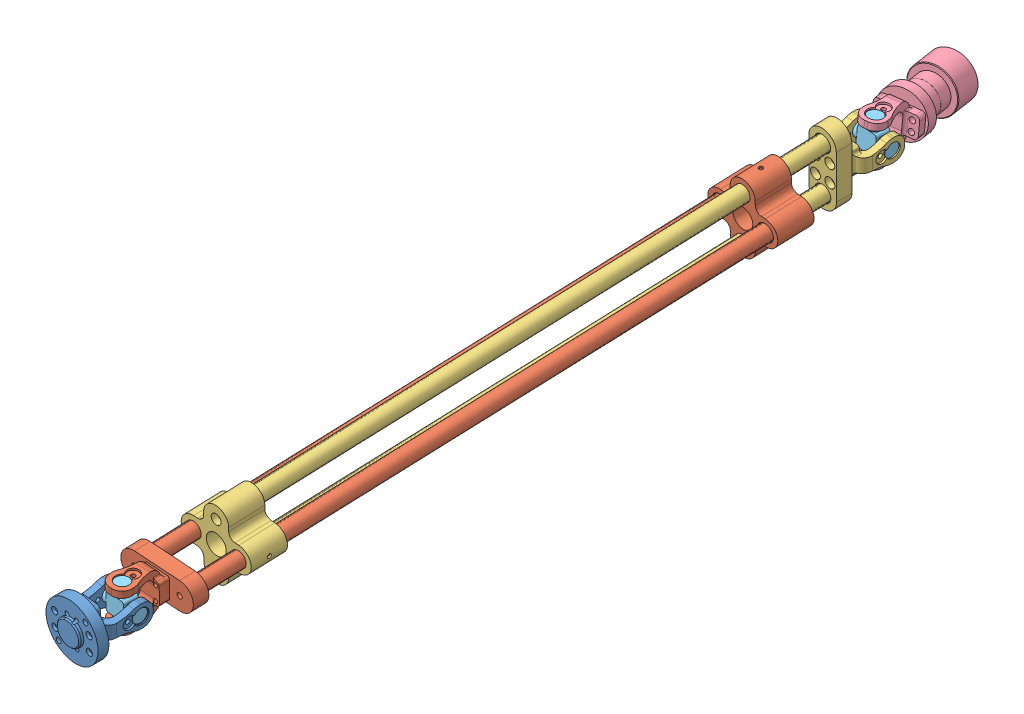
SolidWorks assembly PAR6PL10A004 中间轴.SLDASM, configuration 默认 (file format 7000). Lengths in mm.
Overall size (67.77 90.01 704.56).
6 component instances, 5 part files, 10 mates.
Components (placement in the parent):
- PAR6PL10A004 中间轴-上1-1: PAR6PL10A004 中间轴-上1.SLDPRT [默认] at origin size (44.45 44.44 50.8)
- PAR6PL10A004 中间轴-上2-1: PAR6PL10A004 中间轴-上2.SLDPRT [默认] at (8.8113 27.1532 -0.4023) x (0.999836 0.002846 0.017912) z (-0.017728 -0.055095 0.998324) size (57.94 55.94 517)
- PAR6PL10A004 中间轴-下1-1: PAR6PL10A004 中间轴-下1.SLDPRT [默认] at (8.8636 27.3156 -3.346) x (0.999836 0.002846 0.017912) z (-0.017728 -0.055095 0.998324) size (55.94 57.94 517)
- PAR6PL10A004 中间轴-下2-1: PAR6PL10A004 中间轴-下2.SLDPRT [默认] at (30.6658 32.3586 -15.6175) x (0.959454 -0.011 -0.28165) z (0.281444 -0.0172 0.959424) size (39.6 38.78 89.97)
- 万向轴承-1: 万向轴承.SLDPRT [默认] at (-7.1455 39.8233 492.583) x (0.06978 0.052248 -0.996193) z (-0.052248 -0.997065 -0.055954) size (11 30 30)
- 万向轴承-3: 万向轴承.SLDPRT [默认] at (3.1741 71.8192 -88.8315) x (0.011872 -0.054924 -0.99842) z (-0.053881 -0.997075 0.05421) size (11 30 30)
Mates (geometry in assembly coordinates):
- 同心2: concentric aligned: cylinder of PAR6PL10A004 中间轴-上2-1 through (-7.0933 40.8204 492.6389) axis (-0.052248 -0.997065 -0.055954) radius 5.5; cylinder of 万向轴承-1 through (-7.1455 39.8233 492.583) axis (-0.052248 -0.997065 -0.055954) radius 5.5
- 宽度1: width aligned: plane of PAR6PL10A004 中间轴-上2-1 through (0.6466 9.7582 467.0218) normal (0.052248 0.997065 0.055954); plane of PAR6PL10A004 中间轴-上2-1 through (1.7335 39.8462 501.757) normal (-0.052248 -0.997065 -0.055954); plane of 万向轴承-1 through (-15.9398 39.8539 500.2501) normal (0.052248 0.997065 0.055954); plane of 万向轴承-1 through (-17.5072 9.9419 498.5715) normal (-0.052248 -0.997065 -0.055954)
- 同心3: concentric anti-aligned: cylinder of PAR6PL10A004 中间轴-上1-1 through (8.0099 23.9721 492.8132) axis (-0.996193 0.055954 -0.066845) radius 5.5; cylinder of 万向轴承-1 through (-22.8721 25.7066 490.741) axis (0.996193 -0.055954 0.066845) radius 5.5
- 宽度2: width aligned: plane of 万向轴承-1 through (6.7271 33.8517 505.2398) normal (0.996193 -0.055954 0.066845); plane of 万向轴承-1 through (-23.1587 35.5303 503.2345) normal (-0.996193 0.055954 -0.066845); plane of PAR6PL10A004 中间轴-上1-1 through (9.1056 33.5434 484.4952) normal (0.996193 -0.055954 0.066845); plane of PAR6PL10A004 中间轴-上1-1 through (-25.2422 32.9777 517.1893) normal (-0.996193 0.055954 -0.066845)
- 同心4: concentric aligned: cylinder of PAR6PL10A004 中间轴-上2-1 through (2.4581 72.1741 -39.2435) axis (-0.017728 -0.055095 0.998324) radius 6; cylinder of PAR6PL10A004 中间轴-下1-1 through (2.739 73.0473 -55.0649) axis (-0.017728 -0.055095 0.998324) radius 6
- 同心5: concentric anti-aligned: cylinder of PAR6PL10A004 中间轴-上2-1 through (0.5772 36.2798 -41.2578) axis (-0.017728 -0.055095 0.998324) radius 6; cylinder of PAR6PL10A004 中间轴-下1-1 through (-7.2612 11.9193 400.1531) axis (0.017728 0.055095 -0.998324) radius 6
- 同心6: concentric aligned: cylinder of PAR6PL10A004 中间轴-下2-1 through (3.228 72.8163 -88.8857) axis (-0.053881 -0.997075 0.05421) radius 5.5; cylinder of 万向轴承-3 through (3.1741 71.8192 -88.8315) axis (-0.053881 -0.997075 0.05421) radius 5.5
- 同心7: concentric aligned: cylinder of PAR6PL10A004 中间轴-下1-1 through (-13.6098 57.7136 -88.2551) axis (0.998477 -0.053152 0.014797) radius 5.5; cylinder of 万向轴承-3 through (-12.6113 57.6604 -88.2403) axis (0.998477 -0.053152 0.014797) radius 5.5
- 宽度3: width anti-aligned: plane of 万向轴承-3 through (-5.1613 72.7109 -80.7166) normal (0.053881 0.997075 -0.05421); plane of 万向轴承-3 through (-6.7777 42.7986 -79.0903) normal (-0.053881 -0.997075 0.05421); plane of PAR6PL10A004 中间轴-下2-1 through (5.4595 39.2187 -114.3262) normal (-0.053881 -0.997075 0.05421); plane of PAR6PL10A004 中间轴-下2-1 through (13.7416 72.6381 -81.7141) normal (0.053881 0.997075 -0.05421)
- 宽度4: width aligned: plane of 万向轴承-3 through (-12.1886 68.7652 -76.8746) normal (-0.998477 0.053152 -0.014797); plane of 万向轴承-3 through (17.7657 67.1706 -76.4307) normal (0.998477 -0.053152 0.014797); plane of PAR6PL10A004 中间轴-下1-1 through (17.4458 45.7168 -64.3254) normal (-0.998477 0.053152 -0.014797); plane of PAR6PL10A004 中间轴-下1-1 through (-13.9205 49.2358 -97.7436) normal (0.998477 -0.053152 0.014797)
